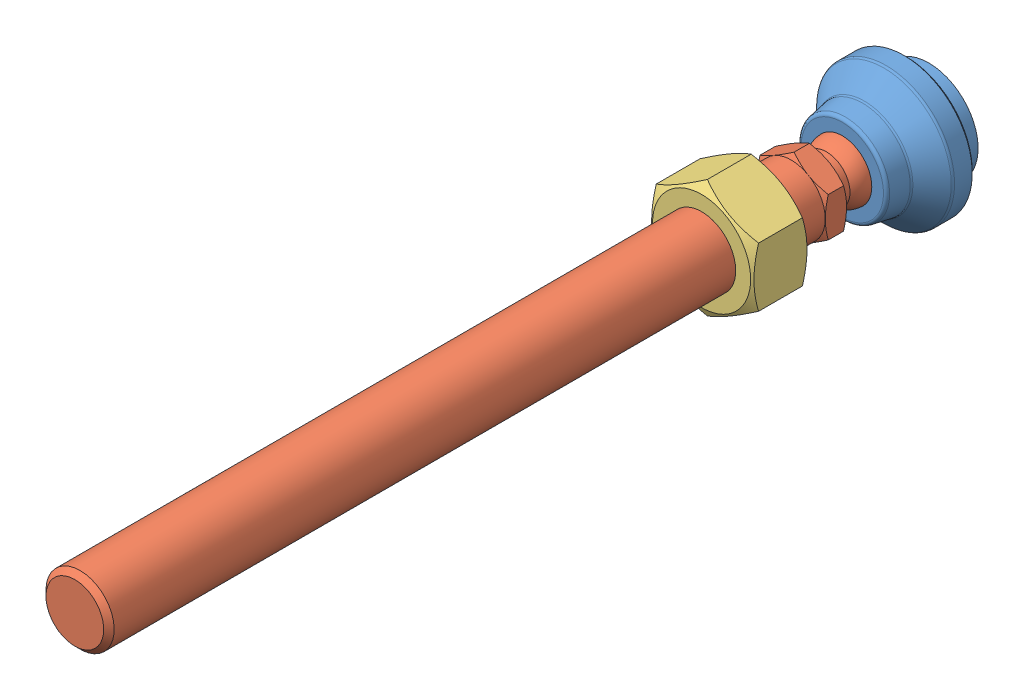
SolidWorks assembly LSVA32-M16X168-SUS.sldasm, configuration Default (file format 15000). Lengths in mm.
Overall size (32 32 200.3).
3 component instances, 3 part files, 0 mates.
Components (placement in the parent):
- LSVA32-M16X168-SUS_01-1: LSVA32-M16X168-SUS_01.SLDPRT [Default] at (0 0 6) x (1 0 0) z (0 -1 0) size (32 20.3 32)
- LSVA32-M16X168-SUS_02-1: LSVA32-M16X168-SUS_02.sldprt [Default] at (0 0 13.5) x (1 0 0) z (0 -1 0) size (16 187.5 18.48)
- LSVA32-M16X168-SUS_03-1: LSVA32-M16X168-SUS_03.sldprt [Default] at (0 0 41) size (24 27.71 13)
